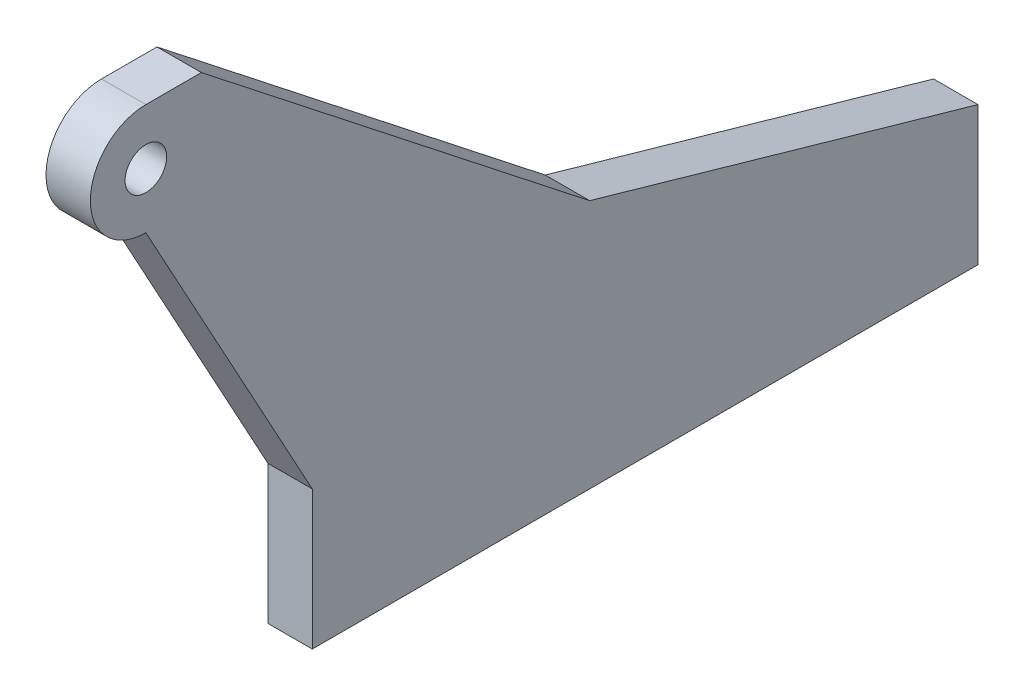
from build123d import *

# Parameters (mm, degrees)
SKETCH_1_R      = 0.75
EXTRUDE_1_DEPTH = 1.6


with BuildPart() as part:
    # Sketch 1 → Extrude 1 (new body)
    with BuildSketch(Plane(origin=(0, 0, 0), x_dir=(0, 0, -1), z_dir=(1, 0, 0))):
        with BuildLine():
            Line((0, 0), (24, 0))
            Line((24, 0), (24, 5))
            Line((24, 5), (10, 9))
            Line((10, 9), (-4, 20))
            Line((-4, 20), (-6, 20))
            ThreePointArc((-6, 20), (-8, 18), (-6, 16))
            Line((-6, 16), (0, 5))
            Line((0, 5), (0, 0))
        make_face()
        with Locations((-6, 18)):
            Circle(SKETCH_1_R, mode=Mode.SUBTRACT)
    extrude(amount=EXTRUDE_1_DEPTH)


solid = part.part
